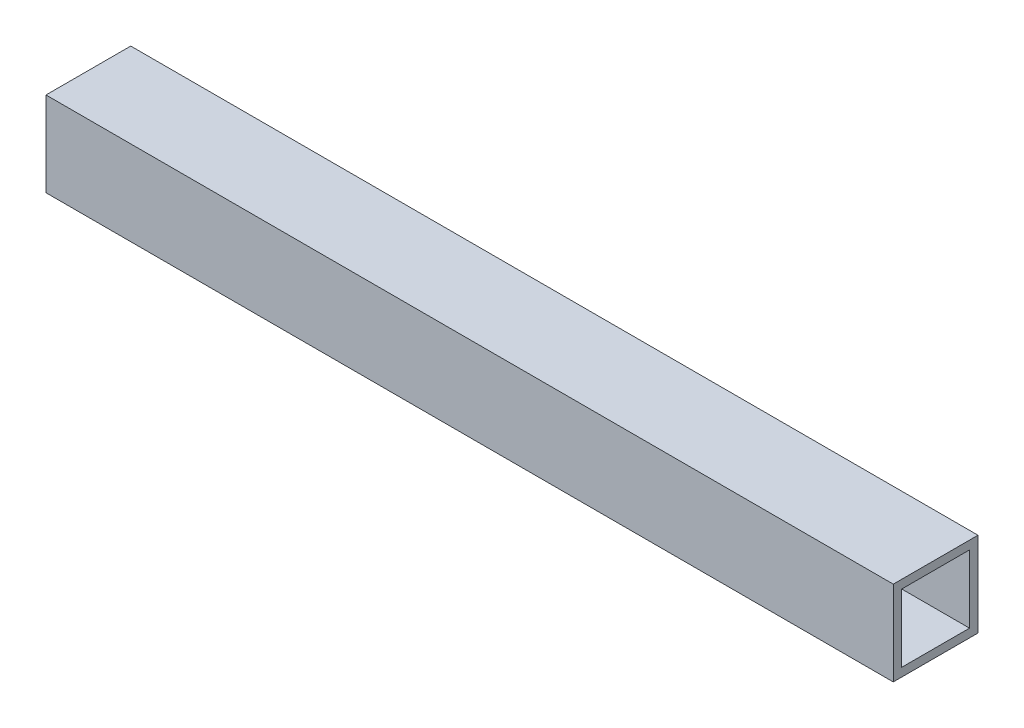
from build123d import *

# Parameters (mm, degrees)
ESQUISSE1_W        = 10
ESQUISSE1_H        = 10
ESQUISSE1_W_2      = 8
ESQUISSE1_H_2      = 8
BOSS_EXTRU_1_DEPTH = 100


with BuildPart() as part:
    # Esquisse1 → Boss.-Extru.1 (new body)
    with BuildSketch(Plane(origin=(0, 0, 0), x_dir=(0, 0, -1), z_dir=(1, 0, 0))):
        with Locations((5, 5)):
            Rectangle(ESQUISSE1_W, ESQUISSE1_H)
        with Locations((5, 5)):
            Rectangle(ESQUISSE1_W_2, ESQUISSE1_H_2, mode=Mode.SUBTRACT)
    extrude(amount=BOSS_EXTRU_1_DEPTH)


solid = part.part
